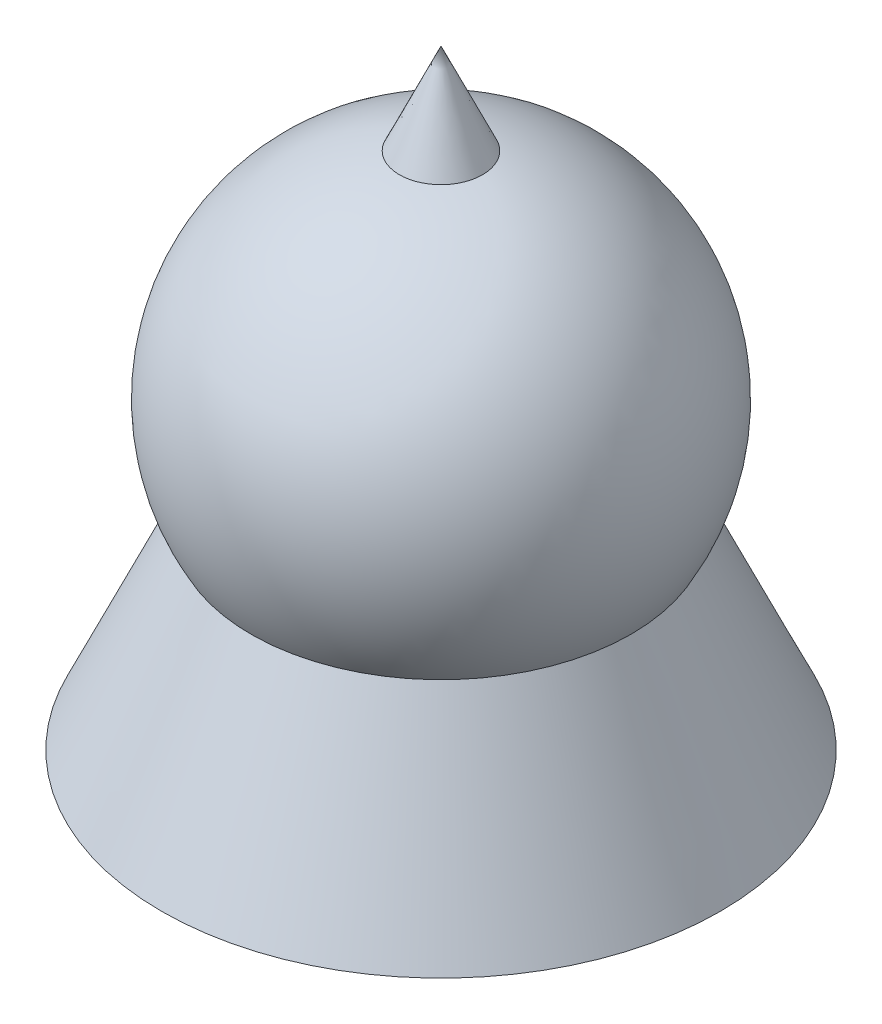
from build123d import *


with BuildPart() as part:
    # Sketch 1 → Revolve 1 (revolve)
    with BuildSketch(Plane.XY, mode=Mode.PRIVATE) as revolve_1_sk:
        Polygon((0, 44.735786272), (-25, -9.807774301), (0, -9.807774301), align=None)
    revolve(revolve_1_sk.sketch.rotate(Axis((0, 82.176470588, 0), (0, -1, 0)), 90), axis=Axis((0, 82.176470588, 0), (0, -1, 0)))

    # Sketch 2 → Revolve 2 (revolve)
    with BuildSketch(Plane.XY):
        with BuildLine():
            Line((0, -2.199218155), (0, 36.976244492))
            ThreePointArc((0, 36.976244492), (-19.587731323, 17.388513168), (0, -2.199218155))
        make_face()
    revolve(axis=Axis((0, 58.834069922, 0), (0, -1, 0)))


solid = part.part
